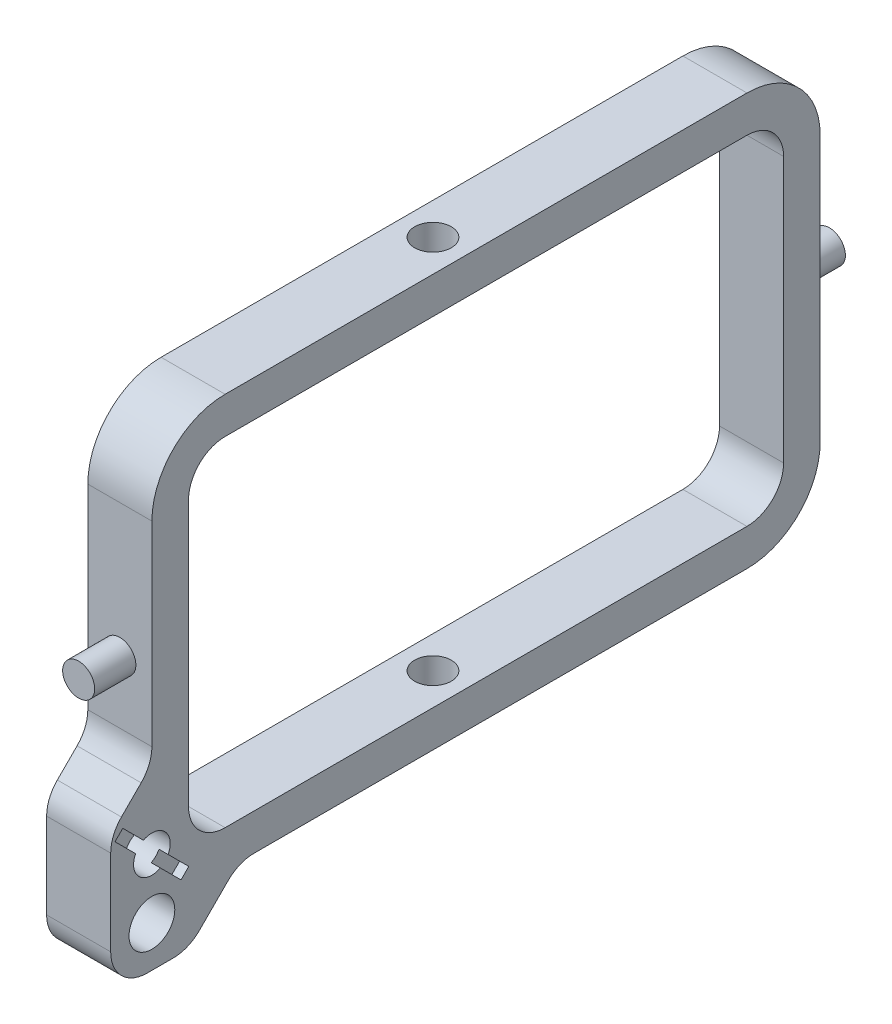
from build123d import *

# Parameters (mm, degrees)
SKETCH1_R           = 2.5
SKETCH1_R_2         = 2
SKETCH1_W           = 37
SKETCH1_H           = 65
BOSS_EXTRUDE1_DEPTH = 7
SKETCH6_R           = 2
CUT_EXTRUDE2_DEPTH  = 90.890210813
SKETCH5_R           = 1.75
BOSS_EXTRUDE3_DEPTH = 4.5
CUT_EXTRUDE3_DEPTH  = 1
FILLET1_R           = 4
FILLET2_R           = 8
FILLET3_R           = 4


with BuildPart() as part:
    # Sketch1 → Boss-Extrude1 (new body)
    with BuildSketch(Plane.YZ):
        Polygon((-22.5, 0), (22.5, 0), (22.5, 73), (-8.5, 73), (-13, 77.5), (-28, 77.5), (-28, 69), (-22.5, 63.5), align=None)
        with Locations(Location((-23.5, 73, 0), (0, 0, 270))):
            Circle(SKETCH1_R, mode=Mode.SUBTRACT)
        with Locations(Location((-17, 73, 0), (0, 0, 270))):
            Circle(SKETCH1_R_2, mode=Mode.SUBTRACT)
        with Locations((0, 36.5)):
            Rectangle(SKETCH1_W, SKETCH1_H, mode=Mode.SUBTRACT)
    extrude(amount=BOSS_EXTRUDE1_DEPTH)

    # Sketch6 → Cut-Extrude2 (cut, through all)
    with BuildSketch(Plane.XZ.offset(22.5)):
        with Locations(Location((3.5, 38.8, 0), (0, 0, 270))):
            Circle(SKETCH6_R)
    extrude(amount=-CUT_EXTRUDE2_DEPTH, mode=Mode.SUBTRACT)

    # Sketch5 → Boss-Extrude3 (add)
    with BuildSketch(Plane(origin=(0, 0, 0), x_dir=(1, 0, 0), z_dir=(0, 0, -1))):
        with Locations((3.5, 0)):
            Circle(SKETCH5_R)
    boss_extrude3 = extrude(amount=BOSS_EXTRUDE3_DEPTH)

    # Mirror2: Boss-Extrude3 across plane
    add(boss_extrude3.mirror(Plane(origin=(0, 0, 36.5), x_dir=(1, 0, 0), z_dir=(0, 0, -1))))

    # Sketch8 → Cut-Extrude3 (cut)
    with BuildSketch(Plane.YZ.offset(7)):
        Polygon((-13.818019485, 77.030508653), (-12.969491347, 76.181980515), (-20.181980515, 68.969491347), (-21.030508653, 69.818019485), align=None)
    extrude(amount=-CUT_EXTRUDE3_DEPTH, mode=Mode.SUBTRACT)

    # Fillet1
    fillet1_edges = [part.edges().sort_by_distance(p)[0] for p in [
        (3.5, -8.5, 73),
        (3.5, -22.5, 63.5),
        (3.5, -28, 69),
        (3.5, -28, 77.5),
        (3.5, -13, 77.5),
    ]]
    fillet(fillet1_edges, radius=FILLET1_R)

    # Fillet2
    fillet2_edges = [part.edges().sort_by_distance(p)[0] for p in [
        (3.5, 22.5, 73),
        (3.5, 22.5, 0),
        (3.5, -22.5, 0),
    ]]
    fillet(fillet2_edges, radius=FILLET2_R)

    # Fillet3
    fillet3_edges = [part.edges().sort_by_distance(p)[0] for p in [
        (3.5, 18.5, 4),
        (3.5, 18.5, 69),
        (3.5, -18.5, 69),
        (3.5, -18.5, 4),
    ]]
    fillet(fillet3_edges, radius=FILLET3_R)


solid = part.part
